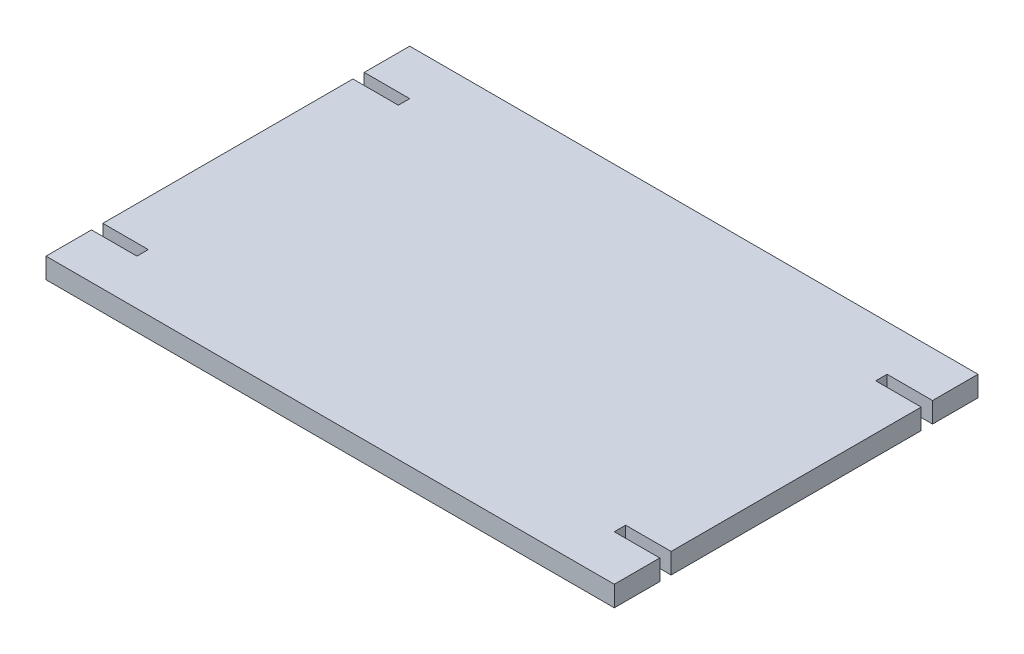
ISO-10303-21;
HEADER;
FILE_DESCRIPTION(('STEP AP214'),'2;1');
FILE_NAME('part.step','',(''),(''),'','','');
FILE_SCHEMA(('AUTOMOTIVE_DESIGN { 1 0 10303 214 1 1 1 1 }'));
ENDSEC;
DATA;
#1=APPLICATION_CONTEXT('core data for automotive mechanical design processes');
#2=APPLICATION_PROTOCOL_DEFINITION('international standard','automotive_design',2000,#1);
#3=PRODUCT_CONTEXT('',#1,'mechanical');
#4=PRODUCT('Part','Part','',(#3));
#5=PRODUCT_RELATED_PRODUCT_CATEGORY('part','',(#4));
#6=PRODUCT_DEFINITION_FORMATION('','',#4);
#7=PRODUCT_DEFINITION_CONTEXT('part definition',#1,'design');
#8=PRODUCT_DEFINITION('design','',#6,#7);
#9=PRODUCT_DEFINITION_SHAPE('','',#8);
#10=(LENGTH_UNIT() NAMED_UNIT(*) SI_UNIT(.MILLI.,.METRE.));
#11=(NAMED_UNIT(*) PLANE_ANGLE_UNIT() SI_UNIT($,.RADIAN.));
#12=(NAMED_UNIT(*) SI_UNIT($,.STERADIAN.) SOLID_ANGLE_UNIT());
#13=UNCERTAINTY_MEASURE_WITH_UNIT(LENGTH_MEASURE(1.E-05),#10,'distance_accuracy_value','');
#14=(GEOMETRIC_REPRESENTATION_CONTEXT(3) GLOBAL_UNCERTAINTY_ASSIGNED_CONTEXT((#13)) GLOBAL_UNIT_ASSIGNED_CONTEXT((#10,
#11,#12)) REPRESENTATION_CONTEXT('',''));
#15=CARTESIAN_POINT('',(0.,0.,0.));
#16=DIRECTION('',(0.,0.,1.));
#17=DIRECTION('',(1.,0.,0.));
#18=AXIS2_PLACEMENT_3D('',#15,#16,#17);
#19=CARTESIAN_POINT('',(-301.875,18.,-168.229166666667));
#20=DIRECTION('',(1.,0.,0.));
#21=DIRECTION('',(0.,0.,-1.));
#22=AXIS2_PLACEMENT_3D('',#19,#20,#21);
#23=PLANE('',#22);
#24=DIRECTION('',(0.,0.,1.));
#25=VECTOR('',#24,1.);
#26=CARTESIAN_POINT('',(-301.875,0.,-168.229166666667));
#27=LINE('',#26,#25);
#28=CARTESIAN_POINT('',(-301.875,0.,-208.229166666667));
#29=VERTEX_POINT('',#28);
#30=CARTESIAN_POINT('',(-301.875,0.,-168.229166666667));
#31=VERTEX_POINT('',#30);
#32=EDGE_CURVE('E201',#29,#31,#27,.T.);
#33=ORIENTED_EDGE('',*,*,#32,.T.);
#34=DIRECTION('',(0.,-1.,0.));
#35=VECTOR('',#34,1.);
#36=CARTESIAN_POINT('',(-301.875,18.,-168.229166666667));
#37=LINE('',#36,#35);
#38=CARTESIAN_POINT('',(-301.875,18.,-168.229166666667));
#39=VERTEX_POINT('',#38);
#40=EDGE_CURVE('E11',#39,#31,#37,.T.);
#41=ORIENTED_EDGE('',*,*,#40,.F.);
#42=DIRECTION('',(0.,0.,1.));
#43=VECTOR('',#42,1.);
#44=CARTESIAN_POINT('',(-301.875,18.,-168.229166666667));
#45=LINE('',#44,#43);
#46=CARTESIAN_POINT('',(-301.875,18.,-208.229166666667));
#47=VERTEX_POINT('',#46);
#48=EDGE_CURVE('E239',#47,#39,#45,.T.);
#49=ORIENTED_EDGE('',*,*,#48,.F.);
#50=DIRECTION('',(0.,-1.,0.));
#51=VECTOR('',#50,1.);
#52=CARTESIAN_POINT('',(-301.875,18.,-208.229166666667));
#53=LINE('',#52,#51);
#54=EDGE_CURVE('E197',#47,#29,#53,.T.);
#55=ORIENTED_EDGE('',*,*,#54,.T.);
#56=EDGE_LOOP('',(#33,#41,#49,#55));
#57=FACE_BOUND('',#56,.T.);
#58=ADVANCED_FACE('F33',(#57),#23,.F.);
#59=CARTESIAN_POINT('',(-261.875,18.,-168.229166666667));
#60=DIRECTION('',(0.,0.,-1.));
#61=DIRECTION('',(-1.,0.,0.));
#62=AXIS2_PLACEMENT_3D('',#59,#60,#61);
#63=PLANE('',#62);
#64=DIRECTION('',(1.,0.,0.));
#65=VECTOR('',#64,1.);
#66=CARTESIAN_POINT('',(-261.875,0.,-168.229166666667));
#67=LINE('',#66,#65);
#68=CARTESIAN_POINT('',(-261.875,0.,-168.229166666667));
#69=VERTEX_POINT('',#68);
#70=EDGE_CURVE('E204',#31,#69,#67,.T.);
#71=ORIENTED_EDGE('',*,*,#70,.T.);
#72=DIRECTION('',(0.,-1.,0.));
#73=VECTOR('',#72,1.);
#74=CARTESIAN_POINT('',(-261.875,18.,-168.229166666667));
#75=LINE('',#74,#73);
#76=CARTESIAN_POINT('',(-261.875,18.,-168.229166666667));
#77=VERTEX_POINT('',#76);
#78=EDGE_CURVE('E41',#77,#69,#75,.T.);
#79=ORIENTED_EDGE('',*,*,#78,.F.);
#80=DIRECTION('',(1.,0.,0.));
#81=VECTOR('',#80,1.);
#82=CARTESIAN_POINT('',(-261.875,18.,-168.229166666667));
#83=LINE('',#82,#81);
#84=EDGE_CURVE('E128',#39,#77,#83,.T.);
#85=ORIENTED_EDGE('',*,*,#84,.F.);
#86=ORIENTED_EDGE('',*,*,#40,.T.);
#87=EDGE_LOOP('',(#71,#79,#85,#86));
#88=FACE_BOUND('',#87,.T.);
#89=ADVANCED_FACE('F357',(#88),#63,.F.);
#90=CARTESIAN_POINT('',(-261.875,18.,-158.229166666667));
#91=DIRECTION('',(1.,0.,0.));
#92=DIRECTION('',(0.,0.,-1.));
#93=AXIS2_PLACEMENT_3D('',#90,#91,#92);
#94=PLANE('',#93);
#95=DIRECTION('',(0.,0.,1.));
#96=VECTOR('',#95,1.);
#97=CARTESIAN_POINT('',(-261.875,0.,-158.229166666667));
#98=LINE('',#97,#96);
#99=CARTESIAN_POINT('',(-261.875,0.,-158.229166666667));
#100=VERTEX_POINT('',#99);
#101=EDGE_CURVE('E206',#69,#100,#98,.T.);
#102=ORIENTED_EDGE('',*,*,#101,.T.);
#103=DIRECTION('',(0.,-1.,0.));
#104=VECTOR('',#103,1.);
#105=CARTESIAN_POINT('',(-261.875,18.,-158.229166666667));
#106=LINE('',#105,#104);
#107=CARTESIAN_POINT('',(-261.875,18.,-158.229166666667));
#108=VERTEX_POINT('',#107);
#109=EDGE_CURVE('E282',#108,#100,#106,.T.);
#110=ORIENTED_EDGE('',*,*,#109,.F.);
#111=DIRECTION('',(0.,0.,1.));
#112=VECTOR('',#111,1.);
#113=CARTESIAN_POINT('',(-261.875,18.,-158.229166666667));
#114=LINE('',#113,#112);
#115=EDGE_CURVE('E290',#77,#108,#114,.T.);
#116=ORIENTED_EDGE('',*,*,#115,.F.);
#117=ORIENTED_EDGE('',*,*,#78,.T.);
#118=EDGE_LOOP('',(#102,#110,#116,#117));
#119=FACE_BOUND('',#118,.T.);
#120=ADVANCED_FACE('F288',(#119),#94,.F.);
#121=CARTESIAN_POINT('',(-301.875,18.,-158.229166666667));
#122=DIRECTION('',(0.,0.,1.));
#123=DIRECTION('',(1.,0.,0.));
#124=AXIS2_PLACEMENT_3D('',#121,#122,#123);
#125=PLANE('',#124);
#126=DIRECTION('',(-1.,0.,0.));
#127=VECTOR('',#126,1.);
#128=CARTESIAN_POINT('',(-301.875,0.,-158.229166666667));
#129=LINE('',#128,#127);
#130=CARTESIAN_POINT('',(-301.875,0.,-158.229166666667));
#131=VERTEX_POINT('',#130);
#132=EDGE_CURVE('E208',#100,#131,#129,.T.);
#133=ORIENTED_EDGE('',*,*,#132,.T.);
#134=DIRECTION('',(0.,-1.,0.));
#135=VECTOR('',#134,1.);
#136=CARTESIAN_POINT('',(-301.875,18.,-158.229166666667));
#137=LINE('',#136,#135);
#138=CARTESIAN_POINT('',(-301.875,18.,-158.229166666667));
#139=VERTEX_POINT('',#138);
#140=EDGE_CURVE('E279',#139,#131,#137,.T.);
#141=ORIENTED_EDGE('',*,*,#140,.F.);
#142=DIRECTION('',(-1.,0.,0.));
#143=VECTOR('',#142,1.);
#144=CARTESIAN_POINT('',(-301.875,18.,-158.229166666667));
#145=LINE('',#144,#143);
#146=EDGE_CURVE('E308',#108,#139,#145,.T.);
#147=ORIENTED_EDGE('',*,*,#146,.F.);
#148=ORIENTED_EDGE('',*,*,#109,.T.);
#149=EDGE_LOOP('',(#133,#141,#147,#148));
#150=FACE_BOUND('',#149,.T.);
#151=ADVANCED_FACE('F299',(#150),#125,.F.);
#152=CARTESIAN_POINT('',(-301.875,18.,61.7708333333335));
#153=DIRECTION('',(1.,0.,0.));
#154=DIRECTION('',(0.,0.,-1.));
#155=AXIS2_PLACEMENT_3D('',#152,#153,#154);
#156=PLANE('',#155);
#157=DIRECTION('',(0.,0.,1.));
#158=VECTOR('',#157,1.);
#159=CARTESIAN_POINT('',(-301.875,0.,61.7708333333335));
#160=LINE('',#159,#158);
#161=CARTESIAN_POINT('',(-301.875,0.,61.7708333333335));
#162=VERTEX_POINT('',#161);
#163=EDGE_CURVE('E210',#131,#162,#160,.T.);
#164=ORIENTED_EDGE('',*,*,#163,.T.);
#165=DIRECTION('',(0.,-1.,0.));
#166=VECTOR('',#165,1.);
#167=CARTESIAN_POINT('',(-301.875,18.,61.7708333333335));
#168=LINE('',#167,#166);
#169=CARTESIAN_POINT('',(-301.875,18.,61.7708333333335));
#170=VERTEX_POINT('',#169);
#171=EDGE_CURVE('E276',#170,#162,#168,.T.);
#172=ORIENTED_EDGE('',*,*,#171,.F.);
#173=DIRECTION('',(0.,0.,1.));
#174=VECTOR('',#173,1.);
#175=CARTESIAN_POINT('',(-301.875,18.,61.7708333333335));
#176=LINE('',#175,#174);
#177=EDGE_CURVE('E305',#139,#170,#176,.T.);
#178=ORIENTED_EDGE('',*,*,#177,.F.);
#179=ORIENTED_EDGE('',*,*,#140,.T.);
#180=EDGE_LOOP('',(#164,#172,#178,#179));
#181=FACE_BOUND('',#180,.T.);
#182=ADVANCED_FACE('F303',(#181),#156,.F.);
#183=CARTESIAN_POINT('',(-261.875,18.,61.7708333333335));
#184=DIRECTION('',(0.,0.,-1.));
#185=DIRECTION('',(-1.,0.,0.));
#186=AXIS2_PLACEMENT_3D('',#183,#184,#185);
#187=PLANE('',#186);
#188=DIRECTION('',(1.,0.,0.));
#189=VECTOR('',#188,1.);
#190=CARTESIAN_POINT('',(-261.875,0.,61.7708333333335));
#191=LINE('',#190,#189);
#192=CARTESIAN_POINT('',(-261.875,0.,61.7708333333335));
#193=VERTEX_POINT('',#192);
#194=EDGE_CURVE('E212',#162,#193,#191,.T.);
#195=ORIENTED_EDGE('',*,*,#194,.T.);
#196=DIRECTION('',(0.,-1.,0.));
#197=VECTOR('',#196,1.);
#198=CARTESIAN_POINT('',(-261.875,18.,61.7708333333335));
#199=LINE('',#198,#197);
#200=CARTESIAN_POINT('',(-261.875,18.,61.7708333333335));
#201=VERTEX_POINT('',#200);
#202=EDGE_CURVE('E273',#201,#193,#199,.T.);
#203=ORIENTED_EDGE('',*,*,#202,.F.);
#204=DIRECTION('',(1.,0.,0.));
#205=VECTOR('',#204,1.);
#206=CARTESIAN_POINT('',(-261.875,18.,61.7708333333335));
#207=LINE('',#206,#205);
#208=EDGE_CURVE('E307',#170,#201,#207,.T.);
#209=ORIENTED_EDGE('',*,*,#208,.F.);
#210=ORIENTED_EDGE('',*,*,#171,.T.);
#211=EDGE_LOOP('',(#195,#203,#209,#210));
#212=FACE_BOUND('',#211,.T.);
#213=ADVANCED_FACE('F370',(#212),#187,.F.);
#214=CARTESIAN_POINT('',(-261.875,18.,71.7708333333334));
#215=DIRECTION('',(1.,0.,0.));
#216=DIRECTION('',(0.,0.,-1.));
#217=AXIS2_PLACEMENT_3D('',#214,#215,#216);
#218=PLANE('',#217);
#219=DIRECTION('',(0.,0.,1.));
#220=VECTOR('',#219,1.);
#221=CARTESIAN_POINT('',(-261.875,0.,71.7708333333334));
#222=LINE('',#221,#220);
#223=CARTESIAN_POINT('',(-261.875,0.,71.7708333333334));
#224=VERTEX_POINT('',#223);
#225=EDGE_CURVE('E214',#193,#224,#222,.T.);
#226=ORIENTED_EDGE('',*,*,#225,.T.);
#227=DIRECTION('',(0.,-1.,0.));
#228=VECTOR('',#227,1.);
#229=CARTESIAN_POINT('',(-261.875,18.,71.7708333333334));
#230=LINE('',#229,#228);
#231=CARTESIAN_POINT('',(-261.875,18.,71.7708333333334));
#232=VERTEX_POINT('',#231);
#233=EDGE_CURVE('E270',#232,#224,#230,.T.);
#234=ORIENTED_EDGE('',*,*,#233,.F.);
#235=DIRECTION('',(0.,0.,1.));
#236=VECTOR('',#235,1.);
#237=CARTESIAN_POINT('',(-261.875,18.,71.7708333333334));
#238=LINE('',#237,#236);
#239=EDGE_CURVE('E310',#201,#232,#238,.T.);
#240=ORIENTED_EDGE('',*,*,#239,.F.);
#241=ORIENTED_EDGE('',*,*,#202,.T.);
#242=EDGE_LOOP('',(#226,#234,#240,#241));
#243=FACE_BOUND('',#242,.T.);
#244=ADVANCED_FACE('F373',(#243),#218,.F.);
#245=CARTESIAN_POINT('',(-301.875,18.,71.7708333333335));
#246=DIRECTION('',(0.,0.,1.));
#247=DIRECTION('',(1.,0.,0.));
#248=AXIS2_PLACEMENT_3D('',#245,#246,#247);
#249=PLANE('',#248);
#250=DIRECTION('',(-1.,0.,0.));
#251=VECTOR('',#250,1.);
#252=CARTESIAN_POINT('',(-301.875,0.,71.7708333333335));
#253=LINE('',#252,#251);
#254=CARTESIAN_POINT('',(-301.875,0.,71.7708333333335));
#255=VERTEX_POINT('',#254);
#256=EDGE_CURVE('E216',#224,#255,#253,.T.);
#257=ORIENTED_EDGE('',*,*,#256,.T.);
#258=DIRECTION('',(0.,-1.,0.));
#259=VECTOR('',#258,1.);
#260=CARTESIAN_POINT('',(-301.875,18.,71.7708333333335));
#261=LINE('',#260,#259);
#262=CARTESIAN_POINT('',(-301.875,18.,71.7708333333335));
#263=VERTEX_POINT('',#262);
#264=EDGE_CURVE('E267',#263,#255,#261,.T.);
#265=ORIENTED_EDGE('',*,*,#264,.F.);
#266=DIRECTION('',(-1.,0.,0.));
#267=VECTOR('',#266,1.);
#268=CARTESIAN_POINT('',(-301.875,18.,71.7708333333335));
#269=LINE('',#268,#267);
#270=EDGE_CURVE('E316',#232,#263,#269,.T.);
#271=ORIENTED_EDGE('',*,*,#270,.F.);
#272=ORIENTED_EDGE('',*,*,#233,.T.);
#273=EDGE_LOOP('',(#257,#265,#271,#272));
#274=FACE_BOUND('',#273,.T.);
#275=ADVANCED_FACE('F377',(#274),#249,.F.);
#276=CARTESIAN_POINT('',(-301.875,18.,111.770833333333));
#277=DIRECTION('',(1.,0.,0.));
#278=DIRECTION('',(0.,0.,-1.));
#279=AXIS2_PLACEMENT_3D('',#276,#277,#278);
#280=PLANE('',#279);
#281=DIRECTION('',(0.,0.,1.));
#282=VECTOR('',#281,1.);
#283=CARTESIAN_POINT('',(-301.875,0.,111.770833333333));
#284=LINE('',#283,#282);
#285=CARTESIAN_POINT('',(-301.875,0.,111.770833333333));
#286=VERTEX_POINT('',#285);
#287=EDGE_CURVE('E218',#255,#286,#284,.T.);
#288=ORIENTED_EDGE('',*,*,#287,.T.);
#289=DIRECTION('',(0.,-1.,0.));
#290=VECTOR('',#289,1.);
#291=CARTESIAN_POINT('',(-301.875,18.,111.770833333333));
#292=LINE('',#291,#290);
#293=CARTESIAN_POINT('',(-301.875,18.,111.770833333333));
#294=VERTEX_POINT('',#293);
#295=EDGE_CURVE('E264',#294,#286,#292,.T.);
#296=ORIENTED_EDGE('',*,*,#295,.F.);
#297=DIRECTION('',(0.,0.,1.));
#298=VECTOR('',#297,1.);
#299=CARTESIAN_POINT('',(-301.875,18.,111.770833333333));
#300=LINE('',#299,#298);
#301=EDGE_CURVE('E318',#263,#294,#300,.T.);
#302=ORIENTED_EDGE('',*,*,#301,.F.);
#303=ORIENTED_EDGE('',*,*,#264,.T.);
#304=EDGE_LOOP('',(#288,#296,#302,#303));
#305=FACE_BOUND('',#304,.T.);
#306=ADVANCED_FACE('F381',(#305),#280,.F.);
#307=CARTESIAN_POINT('',(198.125,18.,111.770833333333));
#308=DIRECTION('',(0.,0.,-1.));
#309=DIRECTION('',(-1.,0.,0.));
#310=AXIS2_PLACEMENT_3D('',#307,#308,#309);
#311=PLANE('',#310);
#312=DIRECTION('',(1.,0.,0.));
#313=VECTOR('',#312,1.);
#314=CARTESIAN_POINT('',(198.125,0.,111.770833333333));
#315=LINE('',#314,#313);
#316=CARTESIAN_POINT('',(198.125,0.,111.770833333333));
#317=VERTEX_POINT('',#316);
#318=EDGE_CURVE('E220',#286,#317,#315,.T.);
#319=ORIENTED_EDGE('',*,*,#318,.T.);
#320=DIRECTION('',(0.,-1.,0.));
#321=VECTOR('',#320,1.);
#322=CARTESIAN_POINT('',(198.125,18.,111.770833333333));
#323=LINE('',#322,#321);
#324=CARTESIAN_POINT('',(198.125,18.,111.770833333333));
#325=VERTEX_POINT('',#324);
#326=EDGE_CURVE('E261',#325,#317,#323,.T.);
#327=ORIENTED_EDGE('',*,*,#326,.F.);
#328=DIRECTION('',(1.,0.,0.));
#329=VECTOR('',#328,1.);
#330=CARTESIAN_POINT('',(198.125,18.,111.770833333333));
#331=LINE('',#330,#329);
#332=EDGE_CURVE('E320',#294,#325,#331,.T.);
#333=ORIENTED_EDGE('',*,*,#332,.F.);
#334=ORIENTED_EDGE('',*,*,#295,.T.);
#335=EDGE_LOOP('',(#319,#327,#333,#334));
#336=FACE_BOUND('',#335,.T.);
#337=ADVANCED_FACE('F385',(#336),#311,.F.);
#338=CARTESIAN_POINT('',(198.125,18.,71.7708333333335));
#339=DIRECTION('',(-1.,0.,0.));
#340=DIRECTION('',(0.,0.,1.));
#341=AXIS2_PLACEMENT_3D('',#338,#339,#340);
#342=PLANE('',#341);
#343=DIRECTION('',(0.,0.,-1.));
#344=VECTOR('',#343,1.);
#345=CARTESIAN_POINT('',(198.125,0.,71.7708333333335));
#346=LINE('',#345,#344);
#347=CARTESIAN_POINT('',(198.125,0.,71.7708333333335));
#348=VERTEX_POINT('',#347);
#349=EDGE_CURVE('E222',#317,#348,#346,.T.);
#350=ORIENTED_EDGE('',*,*,#349,.T.);
#351=DIRECTION('',(0.,-1.,0.));
#352=VECTOR('',#351,1.);
#353=CARTESIAN_POINT('',(198.125,18.,71.7708333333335));
#354=LINE('',#353,#352);
#355=CARTESIAN_POINT('',(198.125,18.,71.7708333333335));
#356=VERTEX_POINT('',#355);
#357=EDGE_CURVE('E258',#356,#348,#354,.T.);
#358=ORIENTED_EDGE('',*,*,#357,.F.);
#359=DIRECTION('',(0.,0.,-1.));
#360=VECTOR('',#359,1.);
#361=CARTESIAN_POINT('',(198.125,18.,71.7708333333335));
#362=LINE('',#361,#360);
#363=EDGE_CURVE('E322',#325,#356,#362,.T.);
#364=ORIENTED_EDGE('',*,*,#363,.F.);
#365=ORIENTED_EDGE('',*,*,#326,.T.);
#366=EDGE_LOOP('',(#350,#358,#364,#365));
#367=FACE_BOUND('',#366,.T.);
#368=ADVANCED_FACE('F389',(#367),#342,.F.);
#369=CARTESIAN_POINT('',(158.125,18.,71.7708333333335));
#370=DIRECTION('',(0.,0.,1.));
#371=DIRECTION('',(1.,0.,0.));
#372=AXIS2_PLACEMENT_3D('',#369,#370,#371);
#373=PLANE('',#372);
#374=DIRECTION('',(-1.,0.,0.));
#375=VECTOR('',#374,1.);
#376=CARTESIAN_POINT('',(158.125,0.,71.7708333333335));
#377=LINE('',#376,#375);
#378=CARTESIAN_POINT('',(158.125,0.,71.7708333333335));
#379=VERTEX_POINT('',#378);
#380=EDGE_CURVE('E224',#348,#379,#377,.T.);
#381=ORIENTED_EDGE('',*,*,#380,.T.);
#382=DIRECTION('',(0.,-1.,0.));
#383=VECTOR('',#382,1.);
#384=CARTESIAN_POINT('',(158.125,18.,71.7708333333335));
#385=LINE('',#384,#383);
#386=CARTESIAN_POINT('',(158.125,18.,71.7708333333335));
#387=VERTEX_POINT('',#386);
#388=EDGE_CURVE('E255',#387,#379,#385,.T.);
#389=ORIENTED_EDGE('',*,*,#388,.F.);
#390=DIRECTION('',(-1.,0.,0.));
#391=VECTOR('',#390,1.);
#392=CARTESIAN_POINT('',(158.125,18.,71.7708333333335));
#393=LINE('',#392,#391);
#394=EDGE_CURVE('E324',#356,#387,#393,.T.);
#395=ORIENTED_EDGE('',*,*,#394,.F.);
#396=ORIENTED_EDGE('',*,*,#357,.T.);
#397=EDGE_LOOP('',(#381,#389,#395,#396));
#398=FACE_BOUND('',#397,.T.);
#399=ADVANCED_FACE('F393',(#398),#373,.F.);
#400=CARTESIAN_POINT('',(158.125,18.,61.7708333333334));
#401=DIRECTION('',(-1.,0.,0.));
#402=DIRECTION('',(0.,0.,1.));
#403=AXIS2_PLACEMENT_3D('',#400,#401,#402);
#404=PLANE('',#403);
#405=DIRECTION('',(0.,0.,-1.));
#406=VECTOR('',#405,1.);
#407=CARTESIAN_POINT('',(158.125,0.,61.7708333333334));
#408=LINE('',#407,#406);
#409=CARTESIAN_POINT('',(158.125,0.,61.7708333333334));
#410=VERTEX_POINT('',#409);
#411=EDGE_CURVE('E226',#379,#410,#408,.T.);
#412=ORIENTED_EDGE('',*,*,#411,.T.);
#413=DIRECTION('',(0.,-1.,0.));
#414=VECTOR('',#413,1.);
#415=CARTESIAN_POINT('',(158.125,18.,61.7708333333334));
#416=LINE('',#415,#414);
#417=CARTESIAN_POINT('',(158.125,18.,61.7708333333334));
#418=VERTEX_POINT('',#417);
#419=EDGE_CURVE('E252',#418,#410,#416,.T.);
#420=ORIENTED_EDGE('',*,*,#419,.F.);
#421=DIRECTION('',(0.,0.,-1.));
#422=VECTOR('',#421,1.);
#423=CARTESIAN_POINT('',(158.125,18.,61.7708333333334));
#424=LINE('',#423,#422);
#425=EDGE_CURVE('E326',#387,#418,#424,.T.);
#426=ORIENTED_EDGE('',*,*,#425,.F.);
#427=ORIENTED_EDGE('',*,*,#388,.T.);
#428=EDGE_LOOP('',(#412,#420,#426,#427));
#429=FACE_BOUND('',#428,.T.);
#430=ADVANCED_FACE('F397',(#429),#404,.F.);
#431=CARTESIAN_POINT('',(198.125,18.,61.7708333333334));
#432=DIRECTION('',(0.,0.,-1.));
#433=DIRECTION('',(-1.,0.,0.));
#434=AXIS2_PLACEMENT_3D('',#431,#432,#433);
#435=PLANE('',#434);
#436=DIRECTION('',(1.,0.,0.));
#437=VECTOR('',#436,1.);
#438=CARTESIAN_POINT('',(198.125,0.,61.7708333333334));
#439=LINE('',#438,#437);
#440=CARTESIAN_POINT('',(198.125,0.,61.7708333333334));
#441=VERTEX_POINT('',#440);
#442=EDGE_CURVE('E228',#410,#441,#439,.T.);
#443=ORIENTED_EDGE('',*,*,#442,.T.);
#444=DIRECTION('',(0.,-1.,0.));
#445=VECTOR('',#444,1.);
#446=CARTESIAN_POINT('',(198.125,18.,61.7708333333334));
#447=LINE('',#446,#445);
#448=CARTESIAN_POINT('',(198.125,18.,61.7708333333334));
#449=VERTEX_POINT('',#448);
#450=EDGE_CURVE('E249',#449,#441,#447,.T.);
#451=ORIENTED_EDGE('',*,*,#450,.F.);
#452=DIRECTION('',(1.,0.,0.));
#453=VECTOR('',#452,1.);
#454=CARTESIAN_POINT('',(198.125,18.,61.7708333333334));
#455=LINE('',#454,#453);
#456=EDGE_CURVE('E328',#418,#449,#455,.T.);
#457=ORIENTED_EDGE('',*,*,#456,.F.);
#458=ORIENTED_EDGE('',*,*,#419,.T.);
#459=EDGE_LOOP('',(#443,#451,#457,#458));
#460=FACE_BOUND('',#459,.T.);
#461=ADVANCED_FACE('F401',(#460),#435,.F.);
#462=CARTESIAN_POINT('',(198.125,18.,-158.229166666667));
#463=DIRECTION('',(-1.,0.,0.));
#464=DIRECTION('',(0.,0.,1.));
#465=AXIS2_PLACEMENT_3D('',#462,#463,#464);
#466=PLANE('',#465);
#467=DIRECTION('',(0.,0.,-1.));
#468=VECTOR('',#467,1.);
#469=CARTESIAN_POINT('',(198.125,0.,-158.229166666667));
#470=LINE('',#469,#468);
#471=CARTESIAN_POINT('',(198.125,0.,-158.229166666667));
#472=VERTEX_POINT('',#471);
#473=EDGE_CURVE('E230',#441,#472,#470,.T.);
#474=ORIENTED_EDGE('',*,*,#473,.T.);
#475=DIRECTION('',(0.,-1.,0.));
#476=VECTOR('',#475,1.);
#477=CARTESIAN_POINT('',(198.125,18.,-158.229166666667));
#478=LINE('',#477,#476);
#479=CARTESIAN_POINT('',(198.125,18.,-158.229166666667));
#480=VERTEX_POINT('',#479);
#481=EDGE_CURVE('E246',#480,#472,#478,.T.);
#482=ORIENTED_EDGE('',*,*,#481,.F.);
#483=DIRECTION('',(0.,0.,-1.));
#484=VECTOR('',#483,1.);
#485=CARTESIAN_POINT('',(198.125,18.,-158.229166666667));
#486=LINE('',#485,#484);
#487=EDGE_CURVE('E330',#449,#480,#486,.T.);
#488=ORIENTED_EDGE('',*,*,#487,.F.);
#489=ORIENTED_EDGE('',*,*,#450,.T.);
#490=EDGE_LOOP('',(#474,#482,#488,#489));
#491=FACE_BOUND('',#490,.T.);
#492=ADVANCED_FACE('F405',(#491),#466,.F.);
#493=CARTESIAN_POINT('',(158.125,18.,-158.229166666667));
#494=DIRECTION('',(0.,0.,1.));
#495=DIRECTION('',(1.,0.,0.));
#496=AXIS2_PLACEMENT_3D('',#493,#494,#495);
#497=PLANE('',#496);
#498=DIRECTION('',(-1.,0.,0.));
#499=VECTOR('',#498,1.);
#500=CARTESIAN_POINT('',(158.125,0.,-158.229166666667));
#501=LINE('',#500,#499);
#502=CARTESIAN_POINT('',(158.125,0.,-158.229166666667));
#503=VERTEX_POINT('',#502);
#504=EDGE_CURVE('E232',#472,#503,#501,.T.);
#505=ORIENTED_EDGE('',*,*,#504,.T.);
#506=DIRECTION('',(0.,-1.,0.));
#507=VECTOR('',#506,1.);
#508=CARTESIAN_POINT('',(158.125,18.,-158.229166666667));
#509=LINE('',#508,#507);
#510=CARTESIAN_POINT('',(158.125,18.,-158.229166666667));
#511=VERTEX_POINT('',#510);
#512=EDGE_CURVE('E243',#511,#503,#509,.T.);
#513=ORIENTED_EDGE('',*,*,#512,.F.);
#514=DIRECTION('',(-1.,0.,0.));
#515=VECTOR('',#514,1.);
#516=CARTESIAN_POINT('',(158.125,18.,-158.229166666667));
#517=LINE('',#516,#515);
#518=EDGE_CURVE('E332',#480,#511,#517,.T.);
#519=ORIENTED_EDGE('',*,*,#518,.F.);
#520=ORIENTED_EDGE('',*,*,#481,.T.);
#521=EDGE_LOOP('',(#505,#513,#519,#520));
#522=FACE_BOUND('',#521,.T.);
#523=ADVANCED_FACE('F338',(#522),#497,.F.);
#524=CARTESIAN_POINT('',(158.125,18.,-168.229166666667));
#525=DIRECTION('',(-1.,0.,0.));
#526=DIRECTION('',(0.,0.,1.));
#527=AXIS2_PLACEMENT_3D('',#524,#525,#526);
#528=PLANE('',#527);
#529=DIRECTION('',(0.,0.,-1.));
#530=VECTOR('',#529,1.);
#531=CARTESIAN_POINT('',(158.125,0.,-168.229166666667));
#532=LINE('',#531,#530);
#533=CARTESIAN_POINT('',(158.125,0.,-168.229166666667));
#534=VERTEX_POINT('',#533);
#535=EDGE_CURVE('E234',#503,#534,#532,.T.);
#536=ORIENTED_EDGE('',*,*,#535,.T.);
#537=DIRECTION('',(0.,-1.,0.));
#538=VECTOR('',#537,1.);
#539=CARTESIAN_POINT('',(158.125,18.,-168.229166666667));
#540=LINE('',#539,#538);
#541=CARTESIAN_POINT('',(158.125,18.,-168.229166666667));
#542=VERTEX_POINT('',#541);
#543=EDGE_CURVE('E192',#542,#534,#540,.T.);
#544=ORIENTED_EDGE('',*,*,#543,.F.);
#545=DIRECTION('',(0.,0.,-1.));
#546=VECTOR('',#545,1.);
#547=CARTESIAN_POINT('',(158.125,18.,-168.229166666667));
#548=LINE('',#547,#546);
#549=EDGE_CURVE('E183',#511,#542,#548,.T.);
#550=ORIENTED_EDGE('',*,*,#549,.F.);
#551=ORIENTED_EDGE('',*,*,#512,.T.);
#552=EDGE_LOOP('',(#536,#544,#550,#551));
#553=FACE_BOUND('',#552,.T.);
#554=ADVANCED_FACE('F342',(#553),#528,.F.);
#555=CARTESIAN_POINT('',(198.125,18.,-168.229166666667));
#556=DIRECTION('',(0.,0.,-1.));
#557=DIRECTION('',(-1.,0.,0.));
#558=AXIS2_PLACEMENT_3D('',#555,#556,#557);
#559=PLANE('',#558);
#560=DIRECTION('',(1.,0.,0.));
#561=VECTOR('',#560,1.);
#562=CARTESIAN_POINT('',(198.125,0.,-168.229166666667));
#563=LINE('',#562,#561);
#564=CARTESIAN_POINT('',(198.125,0.,-168.229166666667));
#565=VERTEX_POINT('',#564);
#566=EDGE_CURVE('E191',#534,#565,#563,.T.);
#567=ORIENTED_EDGE('',*,*,#566,.T.);
#568=DIRECTION('',(0.,-1.,0.));
#569=VECTOR('',#568,1.);
#570=CARTESIAN_POINT('',(198.125,18.,-168.229166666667));
#571=LINE('',#570,#569);
#572=CARTESIAN_POINT('',(198.125,18.,-168.229166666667));
#573=VERTEX_POINT('',#572);
#574=EDGE_CURVE('E188',#573,#565,#571,.T.);
#575=ORIENTED_EDGE('',*,*,#574,.F.);
#576=DIRECTION('',(1.,0.,0.));
#577=VECTOR('',#576,1.);
#578=CARTESIAN_POINT('',(198.125,18.,-168.229166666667));
#579=LINE('',#578,#577);
#580=EDGE_CURVE('E177',#542,#573,#579,.T.);
#581=ORIENTED_EDGE('',*,*,#580,.F.);
#582=ORIENTED_EDGE('',*,*,#543,.T.);
#583=EDGE_LOOP('',(#567,#575,#581,#582));
#584=FACE_BOUND('',#583,.T.);
#585=ADVANCED_FACE('F189',(#584),#559,.F.);
#586=CARTESIAN_POINT('',(198.125,18.,-208.229166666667));
#587=DIRECTION('',(-1.,0.,0.));
#588=DIRECTION('',(0.,0.,1.));
#589=AXIS2_PLACEMENT_3D('',#586,#587,#588);
#590=PLANE('',#589);
#591=DIRECTION('',(0.,0.,-1.));
#592=VECTOR('',#591,1.);
#593=CARTESIAN_POINT('',(198.125,0.,-208.229166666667));
#594=LINE('',#593,#592);
#595=CARTESIAN_POINT('',(198.125,0.,-208.229166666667));
#596=VERTEX_POINT('',#595);
#597=EDGE_CURVE('E114',#565,#596,#594,.T.);
#598=ORIENTED_EDGE('',*,*,#597,.T.);
#599=DIRECTION('',(0.,-1.,0.));
#600=VECTOR('',#599,1.);
#601=CARTESIAN_POINT('',(198.125,18.,-208.229166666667));
#602=LINE('',#601,#600);
#603=CARTESIAN_POINT('',(198.125,18.,-208.229166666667));
#604=VERTEX_POINT('',#603);
#605=EDGE_CURVE('E193',#604,#596,#602,.T.);
#606=ORIENTED_EDGE('',*,*,#605,.F.);
#607=DIRECTION('',(0.,0.,-1.));
#608=VECTOR('',#607,1.);
#609=CARTESIAN_POINT('',(198.125,18.,-208.229166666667));
#610=LINE('',#609,#608);
#611=EDGE_CURVE('E181',#573,#604,#610,.T.);
#612=ORIENTED_EDGE('',*,*,#611,.F.);
#613=ORIENTED_EDGE('',*,*,#574,.T.);
#614=EDGE_LOOP('',(#598,#606,#612,#613));
#615=FACE_BOUND('',#614,.T.);
#616=ADVANCED_FACE('F195',(#615),#590,.F.);
#617=CARTESIAN_POINT('',(-301.875,18.,-208.229166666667));
#618=DIRECTION('',(0.,0.,1.));
#619=DIRECTION('',(1.,0.,0.));
#620=AXIS2_PLACEMENT_3D('',#617,#618,#619);
#621=PLANE('',#620);
#622=DIRECTION('',(-1.,0.,0.));
#623=VECTOR('',#622,1.);
#624=CARTESIAN_POINT('',(-301.875,0.,-208.229166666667));
#625=LINE('',#624,#623);
#626=EDGE_CURVE('E120',#596,#29,#625,.T.);
#627=ORIENTED_EDGE('',*,*,#626,.T.);
#628=ORIENTED_EDGE('',*,*,#54,.F.);
#629=DIRECTION('',(-1.,0.,0.));
#630=VECTOR('',#629,1.);
#631=CARTESIAN_POINT('',(-301.875,18.,-208.229166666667));
#632=LINE('',#631,#630);
#633=EDGE_CURVE('E49',#604,#47,#632,.T.);
#634=ORIENTED_EDGE('',*,*,#633,.F.);
#635=ORIENTED_EDGE('',*,*,#605,.T.);
#636=EDGE_LOOP('',(#627,#628,#634,#635));
#637=FACE_BOUND('',#636,.T.);
#638=ADVANCED_FACE('F346',(#637),#621,.F.);
#639=CARTESIAN_POINT('',(0.,18.,0.));
#640=DIRECTION('',(0.,-1.,0.));
#641=DIRECTION('',(0.,0.,-1.));
#642=AXIS2_PLACEMENT_3D('',#639,#640,#641);
#643=PLANE('',#642);
#644=ORIENTED_EDGE('',*,*,#48,.T.);
#645=ORIENTED_EDGE('',*,*,#84,.T.);
#646=ORIENTED_EDGE('',*,*,#115,.T.);
#647=ORIENTED_EDGE('',*,*,#146,.T.);
#648=ORIENTED_EDGE('',*,*,#177,.T.);
#649=ORIENTED_EDGE('',*,*,#208,.T.);
#650=ORIENTED_EDGE('',*,*,#239,.T.);
#651=ORIENTED_EDGE('',*,*,#270,.T.);
#652=ORIENTED_EDGE('',*,*,#301,.T.);
#653=ORIENTED_EDGE('',*,*,#332,.T.);
#654=ORIENTED_EDGE('',*,*,#363,.T.);
#655=ORIENTED_EDGE('',*,*,#394,.T.);
#656=ORIENTED_EDGE('',*,*,#425,.T.);
#657=ORIENTED_EDGE('',*,*,#456,.T.);
#658=ORIENTED_EDGE('',*,*,#487,.T.);
#659=ORIENTED_EDGE('',*,*,#518,.T.);
#660=ORIENTED_EDGE('',*,*,#549,.T.);
#661=ORIENTED_EDGE('',*,*,#580,.T.);
#662=ORIENTED_EDGE('',*,*,#611,.T.);
#663=ORIENTED_EDGE('',*,*,#633,.T.);
#664=EDGE_LOOP('',(#644,#645,#646,#647,#648,#649,#650,#651,#652,#653,#654,#655,#656,#657,#658,
#659,#660,#661,#662,#663));
#665=FACE_BOUND('',#664,.T.);
#666=ADVANCED_FACE('F179',(#665),#643,.F.);
#667=CARTESIAN_POINT('',(0.,0.,0.));
#668=DIRECTION('',(0.,-1.,0.));
#669=DIRECTION('',(0.,0.,-1.));
#670=AXIS2_PLACEMENT_3D('',#667,#668,#669);
#671=PLANE('',#670);
#672=ORIENTED_EDGE('',*,*,#32,.F.);
#673=ORIENTED_EDGE('',*,*,#626,.F.);
#674=ORIENTED_EDGE('',*,*,#597,.F.);
#675=ORIENTED_EDGE('',*,*,#566,.F.);
#676=ORIENTED_EDGE('',*,*,#535,.F.);
#677=ORIENTED_EDGE('',*,*,#504,.F.);
#678=ORIENTED_EDGE('',*,*,#473,.F.);
#679=ORIENTED_EDGE('',*,*,#442,.F.);
#680=ORIENTED_EDGE('',*,*,#411,.F.);
#681=ORIENTED_EDGE('',*,*,#380,.F.);
#682=ORIENTED_EDGE('',*,*,#349,.F.);
#683=ORIENTED_EDGE('',*,*,#318,.F.);
#684=ORIENTED_EDGE('',*,*,#287,.F.);
#685=ORIENTED_EDGE('',*,*,#256,.F.);
#686=ORIENTED_EDGE('',*,*,#225,.F.);
#687=ORIENTED_EDGE('',*,*,#194,.F.);
#688=ORIENTED_EDGE('',*,*,#163,.F.);
#689=ORIENTED_EDGE('',*,*,#132,.F.);
#690=ORIENTED_EDGE('',*,*,#101,.F.);
#691=ORIENTED_EDGE('',*,*,#70,.F.);
#692=EDGE_LOOP('',(#672,#673,#674,#675,#676,#677,#678,#679,#680,#681,#682,#683,#684,#685,#686,
#687,#688,#689,#690,#691));
#693=FACE_BOUND('',#692,.T.);
#694=ADVANCED_FACE('F294',(#693),#671,.T.);
#695=CLOSED_SHELL('',(#58,#89,#120,#151,#182,#213,#244,#275,#306,#337,#368,#399,#430,#461,#492,
#523,#554,#585,#616,#638,#666,#694));
#696=MANIFOLD_SOLID_BREP('B2',#695);
#697=ADVANCED_BREP_SHAPE_REPRESENTATION('',(#18,#696),#14);
#698=SHAPE_DEFINITION_REPRESENTATION(#9,#697);
ENDSEC;
END-ISO-10303-21;
